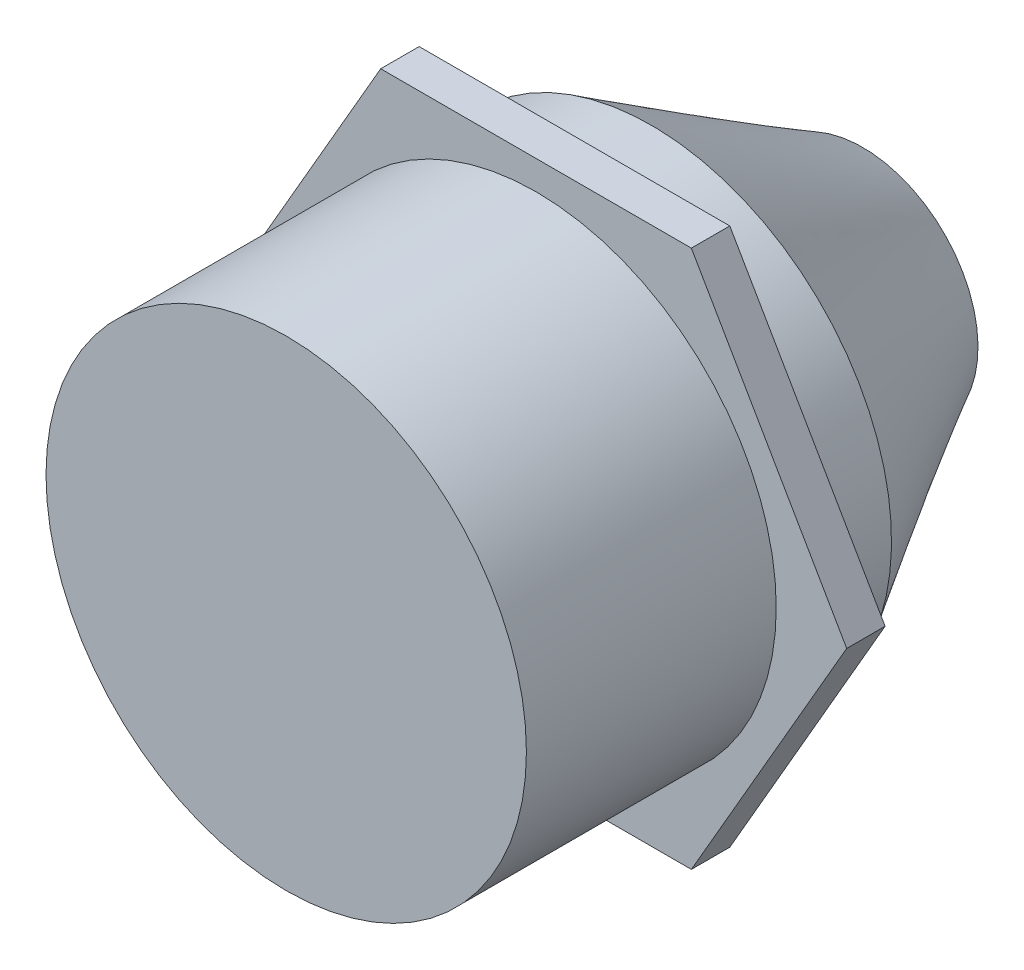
ISO-10303-21;
HEADER;
FILE_DESCRIPTION(('STEP AP214'),'2;1');
FILE_NAME('part.step','',(''),(''),'','','');
FILE_SCHEMA(('AUTOMOTIVE_DESIGN { 1 0 10303 214 1 1 1 1 }'));
ENDSEC;
DATA;
#1=APPLICATION_CONTEXT('core data for automotive mechanical design processes');
#2=APPLICATION_PROTOCOL_DEFINITION('international standard','automotive_design',2000,#1);
#3=PRODUCT_CONTEXT('',#1,'mechanical');
#4=PRODUCT('Part','Part','',(#3));
#5=PRODUCT_RELATED_PRODUCT_CATEGORY('part','',(#4));
#6=PRODUCT_DEFINITION_FORMATION('','',#4);
#7=PRODUCT_DEFINITION_CONTEXT('part definition',#1,'design');
#8=PRODUCT_DEFINITION('design','',#6,#7);
#9=PRODUCT_DEFINITION_SHAPE('','',#8);
#10=(LENGTH_UNIT() NAMED_UNIT(*) SI_UNIT(.MILLI.,.METRE.));
#11=(NAMED_UNIT(*) PLANE_ANGLE_UNIT() SI_UNIT($,.RADIAN.));
#12=(NAMED_UNIT(*) SI_UNIT($,.STERADIAN.) SOLID_ANGLE_UNIT());
#13=UNCERTAINTY_MEASURE_WITH_UNIT(LENGTH_MEASURE(1.E-05),#10,'distance_accuracy_value','');
#14=(GEOMETRIC_REPRESENTATION_CONTEXT(3) GLOBAL_UNCERTAINTY_ASSIGNED_CONTEXT((#13)) GLOBAL_UNIT_ASSIGNED_CONTEXT((#10,
#11,#12)) REPRESENTATION_CONTEXT('',''));
#15=CARTESIAN_POINT('',(0.,0.,0.));
#16=DIRECTION('',(0.,0.,1.));
#17=DIRECTION('',(1.,0.,0.));
#18=AXIS2_PLACEMENT_3D('',#15,#16,#17);
#19=CARTESIAN_POINT('',(0.,0.,-130.));
#20=DIRECTION('',(0.,0.,1.));
#21=DIRECTION('',(1.,0.,0.));
#22=AXIS2_PLACEMENT_3D('',#19,#20,#21);
#23=CYLINDRICAL_SURFACE('',#22,125.);
#24=CARTESIAN_POINT('',(0.,0.,-130.));
#25=DIRECTION('',(0.,0.,1.));
#26=DIRECTION('',(1.,0.,0.));
#27=AXIS2_PLACEMENT_3D('',#24,#25,#26);
#28=CIRCLE('',#27,125.);
#29=CARTESIAN_POINT('',(125.,0.,-130.));
#30=VERTEX_POINT('',#29);
#31=EDGE_CURVE('E149',#30,#30,#28,.T.);
#32=ORIENTED_EDGE('',*,*,#31,.T.);
#33=EDGE_LOOP('',(#32));
#34=FACE_BOUND('',#33,.T.);
#35=CARTESIAN_POINT('',(0.,0.,0.));
#36=DIRECTION('',(0.,0.,1.));
#37=DIRECTION('',(1.,0.,0.));
#38=AXIS2_PLACEMENT_3D('',#35,#36,#37);
#39=CIRCLE('',#38,125.);
#40=CARTESIAN_POINT('',(125.,0.,0.));
#41=VERTEX_POINT('',#40);
#42=EDGE_CURVE('E51',#41,#41,#39,.T.);
#43=ORIENTED_EDGE('',*,*,#42,.F.);
#44=EDGE_LOOP('',(#43));
#45=FACE_BOUND('',#44,.T.);
#46=ADVANCED_FACE('F42',(#34,#45),#23,.T.);
#47=CARTESIAN_POINT('',(0.,0.,0.));
#48=DIRECTION('',(0.,0.,1.));
#49=DIRECTION('',(1.,0.,0.));
#50=AXIS2_PLACEMENT_3D('',#47,#48,#49);
#51=PLANE('',#50);
#52=ORIENTED_EDGE('',*,*,#42,.T.);
#53=EDGE_LOOP('',(#52));
#54=FACE_BOUND('',#53,.T.);
#55=ADVANCED_FACE('F195',(#54),#51,.T.);
#56=CARTESIAN_POINT('',(-161.658075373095,0.,-150.));
#57=DIRECTION('',(0.866025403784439,-0.5,0.));
#58=DIRECTION('',(0.5,0.866025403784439,0.));
#59=AXIS2_PLACEMENT_3D('',#56,#57,#58);
#60=PLANE('',#59);
#61=DIRECTION('',(0.5,0.866025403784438,0.));
#62=VECTOR('',#61,1.);
#63=CARTESIAN_POINT('',(-161.658075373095,0.,-130.));
#64=LINE('',#63,#62);
#65=CARTESIAN_POINT('',(-161.658075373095,0.,-130.));
#66=VERTEX_POINT('',#65);
#67=CARTESIAN_POINT('',(-80.8290376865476,140.,-130.));
#68=VERTEX_POINT('',#67);
#69=EDGE_CURVE('E129',#66,#68,#64,.T.);
#70=ORIENTED_EDGE('',*,*,#69,.T.);
#71=DIRECTION('',(0.,0.,1.));
#72=VECTOR('',#71,1.);
#73=CARTESIAN_POINT('',(-80.8290376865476,140.,-150.));
#74=LINE('',#73,#72);
#75=CARTESIAN_POINT('',(-80.8290376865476,140.,-150.));
#76=VERTEX_POINT('',#75);
#77=EDGE_CURVE('E147',#76,#68,#74,.T.);
#78=ORIENTED_EDGE('',*,*,#77,.F.);
#79=DIRECTION('',(0.5,0.866025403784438,0.));
#80=VECTOR('',#79,1.);
#81=CARTESIAN_POINT('',(-161.658075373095,0.,-150.));
#82=LINE('',#81,#80);
#83=CARTESIAN_POINT('',(-161.658075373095,0.,-150.));
#84=VERTEX_POINT('',#83);
#85=EDGE_CURVE('E140',#84,#76,#82,.T.);
#86=ORIENTED_EDGE('',*,*,#85,.F.);
#87=DIRECTION('',(0.,0.,1.));
#88=VECTOR('',#87,1.);
#89=CARTESIAN_POINT('',(-161.658075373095,0.,-150.));
#90=LINE('',#89,#88);
#91=EDGE_CURVE('E125',#84,#66,#90,.T.);
#92=ORIENTED_EDGE('',*,*,#91,.T.);
#93=EDGE_LOOP('',(#70,#78,#86,#92));
#94=FACE_BOUND('',#93,.T.);
#95=ADVANCED_FACE('F181',(#94),#60,.F.);
#96=CARTESIAN_POINT('',(-80.8290376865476,140.,-150.));
#97=DIRECTION('',(0.,-1.,0.));
#98=DIRECTION('',(1.,0.,0.));
#99=AXIS2_PLACEMENT_3D('',#96,#97,#98);
#100=PLANE('',#99);
#101=DIRECTION('',(1.,0.,0.));
#102=VECTOR('',#101,1.);
#103=CARTESIAN_POINT('',(-80.8290376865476,140.,-130.));
#104=LINE('',#103,#102);
#105=CARTESIAN_POINT('',(80.8290376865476,140.,-130.));
#106=VERTEX_POINT('',#105);
#107=EDGE_CURVE('E132',#68,#106,#104,.T.);
#108=ORIENTED_EDGE('',*,*,#107,.T.);
#109=DIRECTION('',(0.,0.,1.));
#110=VECTOR('',#109,1.);
#111=CARTESIAN_POINT('',(80.8290376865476,140.,-150.));
#112=LINE('',#111,#110);
#113=CARTESIAN_POINT('',(80.8290376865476,140.,-150.));
#114=VERTEX_POINT('',#113);
#115=EDGE_CURVE('E144',#114,#106,#112,.T.);
#116=ORIENTED_EDGE('',*,*,#115,.F.);
#117=DIRECTION('',(1.,0.,0.));
#118=VECTOR('',#117,1.);
#119=CARTESIAN_POINT('',(-80.8290376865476,140.,-150.));
#120=LINE('',#119,#118);
#121=EDGE_CURVE('E98',#76,#114,#120,.T.);
#122=ORIENTED_EDGE('',*,*,#121,.F.);
#123=ORIENTED_EDGE('',*,*,#77,.T.);
#124=EDGE_LOOP('',(#108,#116,#122,#123));
#125=FACE_BOUND('',#124,.T.);
#126=ADVANCED_FACE('F173',(#125),#100,.F.);
#127=CARTESIAN_POINT('',(80.8290376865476,140.,-150.));
#128=DIRECTION('',(-0.866025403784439,-0.5,0.));
#129=DIRECTION('',(0.5,-0.866025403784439,0.));
#130=AXIS2_PLACEMENT_3D('',#127,#128,#129);
#131=PLANE('',#130);
#132=DIRECTION('',(0.499999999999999,-0.866025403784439,0.));
#133=VECTOR('',#132,1.);
#134=CARTESIAN_POINT('',(80.8290376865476,140.,-130.));
#135=LINE('',#134,#133);
#136=CARTESIAN_POINT('',(161.658075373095,-1.11022302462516E-13,-130.));
#137=VERTEX_POINT('',#136);
#138=EDGE_CURVE('E135',#106,#137,#135,.T.);
#139=ORIENTED_EDGE('',*,*,#138,.T.);
#140=DIRECTION('',(0.,0.,1.));
#141=VECTOR('',#140,1.);
#142=CARTESIAN_POINT('',(161.658075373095,-1.11022302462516E-13,-150.));
#143=LINE('',#142,#141);
#144=CARTESIAN_POINT('',(161.658075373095,-1.11022302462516E-13,-150.));
#145=VERTEX_POINT('',#144);
#146=EDGE_CURVE('E120',#145,#137,#143,.T.);
#147=ORIENTED_EDGE('',*,*,#146,.F.);
#148=DIRECTION('',(0.499999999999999,-0.866025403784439,0.));
#149=VECTOR('',#148,1.);
#150=CARTESIAN_POINT('',(80.8290376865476,140.,-150.));
#151=LINE('',#150,#149);
#152=EDGE_CURVE('E111',#114,#145,#151,.T.);
#153=ORIENTED_EDGE('',*,*,#152,.F.);
#154=ORIENTED_EDGE('',*,*,#115,.T.);
#155=EDGE_LOOP('',(#139,#147,#153,#154));
#156=FACE_BOUND('',#155,.T.);
#157=ADVANCED_FACE('F176',(#156),#131,.F.);
#158=CARTESIAN_POINT('',(161.658075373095,-1.11022302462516E-13,-150.));
#159=DIRECTION('',(-0.866025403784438,0.5,0.));
#160=DIRECTION('',(-0.5,-0.866025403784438,0.));
#161=AXIS2_PLACEMENT_3D('',#158,#159,#160);
#162=PLANE('',#161);
#163=DIRECTION('',(-0.5,-0.866025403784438,0.));
#164=VECTOR('',#163,1.);
#165=CARTESIAN_POINT('',(161.658075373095,-1.11022302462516E-13,-130.));
#166=LINE('',#165,#164);
#167=CARTESIAN_POINT('',(80.8290376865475,-140.,-130.));
#168=VERTEX_POINT('',#167);
#169=EDGE_CURVE('E119',#137,#168,#166,.T.);
#170=ORIENTED_EDGE('',*,*,#169,.T.);
#171=DIRECTION('',(0.,0.,1.));
#172=VECTOR('',#171,1.);
#173=CARTESIAN_POINT('',(80.8290376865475,-140.,-150.));
#174=LINE('',#173,#172);
#175=CARTESIAN_POINT('',(80.8290376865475,-140.,-150.));
#176=VERTEX_POINT('',#175);
#177=EDGE_CURVE('E116',#176,#168,#174,.T.);
#178=ORIENTED_EDGE('',*,*,#177,.F.);
#179=DIRECTION('',(-0.5,-0.866025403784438,0.));
#180=VECTOR('',#179,1.);
#181=CARTESIAN_POINT('',(161.658075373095,-1.11022302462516E-13,-150.));
#182=LINE('',#181,#180);
#183=EDGE_CURVE('E105',#145,#176,#182,.T.);
#184=ORIENTED_EDGE('',*,*,#183,.F.);
#185=ORIENTED_EDGE('',*,*,#146,.T.);
#186=EDGE_LOOP('',(#170,#178,#184,#185));
#187=FACE_BOUND('',#186,.T.);
#188=ADVANCED_FACE('F117',(#187),#162,.F.);
#189=CARTESIAN_POINT('',(80.8290376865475,-140.,-150.));
#190=DIRECTION('',(0.,1.,0.));
#191=DIRECTION('',(-1.,0.,0.));
#192=AXIS2_PLACEMENT_3D('',#189,#190,#191);
#193=PLANE('',#192);
#194=DIRECTION('',(-1.,0.,0.));
#195=VECTOR('',#194,1.);
#196=CARTESIAN_POINT('',(80.8290376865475,-140.,-130.));
#197=LINE('',#196,#195);
#198=CARTESIAN_POINT('',(-80.8290376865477,-140.,-130.));
#199=VERTEX_POINT('',#198);
#200=EDGE_CURVE('E83',#168,#199,#197,.T.);
#201=ORIENTED_EDGE('',*,*,#200,.T.);
#202=DIRECTION('',(0.,0.,1.));
#203=VECTOR('',#202,1.);
#204=CARTESIAN_POINT('',(-80.8290376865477,-140.,-150.));
#205=LINE('',#204,#203);
#206=CARTESIAN_POINT('',(-80.8290376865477,-140.,-150.));
#207=VERTEX_POINT('',#206);
#208=EDGE_CURVE('E121',#207,#199,#205,.T.);
#209=ORIENTED_EDGE('',*,*,#208,.F.);
#210=DIRECTION('',(-1.,0.,0.));
#211=VECTOR('',#210,1.);
#212=CARTESIAN_POINT('',(80.8290376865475,-140.,-150.));
#213=LINE('',#212,#211);
#214=EDGE_CURVE('E109',#176,#207,#213,.T.);
#215=ORIENTED_EDGE('',*,*,#214,.F.);
#216=ORIENTED_EDGE('',*,*,#177,.T.);
#217=EDGE_LOOP('',(#201,#209,#215,#216));
#218=FACE_BOUND('',#217,.T.);
#219=ADVANCED_FACE('F123',(#218),#193,.F.);
#220=CARTESIAN_POINT('',(-80.8290376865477,-140.,-150.));
#221=DIRECTION('',(0.866025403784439,0.499999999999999,0.));
#222=DIRECTION('',(-0.499999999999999,0.866025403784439,0.));
#223=AXIS2_PLACEMENT_3D('',#220,#221,#222);
#224=PLANE('',#223);
#225=DIRECTION('',(-0.499999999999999,0.866025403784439,0.));
#226=VECTOR('',#225,1.);
#227=CARTESIAN_POINT('',(-80.8290376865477,-140.,-130.));
#228=LINE('',#227,#226);
#229=EDGE_CURVE('E89',#199,#66,#228,.T.);
#230=ORIENTED_EDGE('',*,*,#229,.T.);
#231=ORIENTED_EDGE('',*,*,#91,.F.);
#232=DIRECTION('',(-0.499999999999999,0.866025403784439,0.));
#233=VECTOR('',#232,1.);
#234=CARTESIAN_POINT('',(-80.8290376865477,-140.,-150.));
#235=LINE('',#234,#233);
#236=EDGE_CURVE('E60',#207,#84,#235,.T.);
#237=ORIENTED_EDGE('',*,*,#236,.F.);
#238=ORIENTED_EDGE('',*,*,#208,.T.);
#239=EDGE_LOOP('',(#230,#231,#237,#238));
#240=FACE_BOUND('',#239,.T.);
#241=ADVANCED_FACE('F182',(#240),#224,.F.);
#242=CARTESIAN_POINT('',(0.,0.,-150.));
#243=DIRECTION('',(0.,0.,-1.));
#244=DIRECTION('',(-1.,0.,0.));
#245=AXIS2_PLACEMENT_3D('',#242,#243,#244);
#246=PLANE('',#245);
#247=CARTESIAN_POINT('',(0.,0.,-150.));
#248=DIRECTION('',(0.,0.,-1.));
#249=DIRECTION('',(-1.,0.,0.));
#250=AXIS2_PLACEMENT_3D('',#247,#248,#249);
#251=CIRCLE('',#250,125.);
#252=CARTESIAN_POINT('',(-125.,0.,-150.));
#253=VERTEX_POINT('',#252);
#254=EDGE_CURVE('E12',#253,#253,#251,.T.);
#255=ORIENTED_EDGE('',*,*,#254,.F.);
#256=EDGE_LOOP('',(#255));
#257=FACE_BOUND('',#256,.T.);
#258=ORIENTED_EDGE('',*,*,#85,.T.);
#259=ORIENTED_EDGE('',*,*,#121,.T.);
#260=ORIENTED_EDGE('',*,*,#152,.T.);
#261=ORIENTED_EDGE('',*,*,#183,.T.);
#262=ORIENTED_EDGE('',*,*,#214,.T.);
#263=ORIENTED_EDGE('',*,*,#236,.T.);
#264=EDGE_LOOP('',(#258,#259,#260,#261,#262,#263));
#265=FACE_BOUND('',#264,.T.);
#266=ADVANCED_FACE('F107',(#257,#265),#246,.T.);
#267=CARTESIAN_POINT('',(0.,0.,-130.));
#268=DIRECTION('',(0.,0.,-1.));
#269=DIRECTION('',(-1.,0.,0.));
#270=AXIS2_PLACEMENT_3D('',#267,#268,#269);
#271=PLANE('',#270);
#272=ORIENTED_EDGE('',*,*,#31,.F.);
#273=EDGE_LOOP('',(#272));
#274=FACE_BOUND('',#273,.T.);
#275=ORIENTED_EDGE('',*,*,#69,.F.);
#276=ORIENTED_EDGE('',*,*,#229,.F.);
#277=ORIENTED_EDGE('',*,*,#200,.F.);
#278=ORIENTED_EDGE('',*,*,#169,.F.);
#279=ORIENTED_EDGE('',*,*,#138,.F.);
#280=ORIENTED_EDGE('',*,*,#107,.F.);
#281=EDGE_LOOP('',(#275,#276,#277,#278,#279,#280));
#282=FACE_BOUND('',#281,.T.);
#283=ADVANCED_FACE('F179',(#274,#282),#271,.F.);
#284=CARTESIAN_POINT('',(0.,0.,-190.));
#285=DIRECTION('',(0.,0.,1.));
#286=DIRECTION('',(1.,0.,0.));
#287=AXIS2_PLACEMENT_3D('',#284,#285,#286);
#288=CYLINDRICAL_SURFACE('',#287,125.);
#289=CARTESIAN_POINT('',(0.,0.,-190.));
#290=DIRECTION('',(0.,0.,1.));
#291=DIRECTION('',(1.,0.,0.));
#292=AXIS2_PLACEMENT_3D('',#289,#290,#291);
#293=CIRCLE('',#292,125.);
#294=CARTESIAN_POINT('',(124.717613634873,8.39743110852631,-190.));
#295=VERTEX_POINT('',#294);
#296=EDGE_CURVE('E133',#295,#295,#293,.F.);
#297=ORIENTED_EDGE('',*,*,#296,.F.);
#298=EDGE_LOOP('',(#297));
#299=FACE_BOUND('',#298,.T.);
#300=ORIENTED_EDGE('',*,*,#254,.T.);
#301=EDGE_LOOP('',(#300));
#302=FACE_BOUND('',#301,.T.);
#303=ADVANCED_FACE('F205',(#299,#302),#288,.T.);
#304=CARTESIAN_POINT('',(0.,0.,-300.));
#305=DIRECTION('',(0.,0.,1.));
#306=DIRECTION('',(1.,0.,0.));
#307=AXIS2_PLACEMENT_3D('',#304,#305,#306);
#308=PLANE('',#307);
#309=CARTESIAN_POINT('',(0.,0.,-300.));
#310=DIRECTION('',(0.,0.,1.));
#311=DIRECTION('',(1.,0.,0.));
#312=AXIS2_PLACEMENT_3D('',#309,#310,#311);
#313=CIRCLE('',#312,60.);
#314=CARTESIAN_POINT('',(58.4461440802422,-13.5664380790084,-300.));
#315=VERTEX_POINT('',#314);
#316=EDGE_CURVE('E154',#315,#315,#313,.T.);
#317=ORIENTED_EDGE('',*,*,#316,.F.);
#318=EDGE_LOOP('',(#317));
#319=FACE_BOUND('',#318,.T.);
#320=ADVANCED_FACE('F209',(#319),#308,.F.);
#321=CARTESIAN_POINT('',(124.717613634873,8.39743110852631,-190.));
#322=CARTESIAN_POINT('',(58.4461440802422,-13.5664380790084,-300.));
#323=CARTESIAN_POINT('',(141.512475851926,-241.03779616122,-190.));
#324=CARTESIAN_POINT('',(31.3132679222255,-130.458726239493,-300.));
#325=CARTESIAN_POINT('',(-107.922751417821,-257.832658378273,-190.));
#326=CARTESIAN_POINT('',(-85.5790202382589,-103.325850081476,-300.));
#327=CARTESIAN_POINT('',(-124.717613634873,-8.39743110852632,-190.));
#328=CARTESIAN_POINT('',(-58.4461440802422,13.5664380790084,-300.));
#329=CARTESIAN_POINT('',(-141.512475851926,241.03779616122,-190.));
#330=CARTESIAN_POINT('',(-31.3132679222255,130.458726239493,-300.));
#331=CARTESIAN_POINT('',(107.922751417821,257.832658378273,-190.));
#332=CARTESIAN_POINT('',(85.579020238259,103.325850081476,-300.));
#333=CARTESIAN_POINT('',(124.717613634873,8.39743110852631,-190.));
#334=CARTESIAN_POINT('',(58.4461440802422,-13.5664380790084,-300.));
#335=(BOUNDED_SURFACE() B_SPLINE_SURFACE(3,1,((#321,#322),(#323,#324),(#325,#326),(#327,#328),
(#329,#330),(#331,#332),(#333,#334)),.UNSPECIFIED.,.T.,.F.,.F.) B_SPLINE_SURFACE_WITH_KNOTS((4,
3,4),(2,2),(0.,0.5,1.),(0.,1.),
.UNSPECIFIED.) GEOMETRIC_REPRESENTATION_ITEM() RATIONAL_B_SPLINE_SURFACE(((1.,1.),
(0.333333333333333,0.333333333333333),(0.333333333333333,0.333333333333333),(1.,1.),
(0.333333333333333,0.333333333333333),(0.333333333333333,0.333333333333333),(1.,1.))) REPRESENTATION_ITEM('') SURFACE());
#336=CARTESIAN_POINT('',(124.717613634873,8.39743110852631,-190.));
#337=CARTESIAN_POINT('',(124.027285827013,8.16864080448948,-191.145833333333));
#338=CARTESIAN_POINT('',(123.336958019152,7.93985050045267,-192.291666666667));
#339=CARTESIAN_POINT('',(121.95630240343,7.48226989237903,-194.583333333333));
#340=CARTESIAN_POINT('',(121.26597459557,7.25347958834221,-195.729166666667));
#341=CARTESIAN_POINT('',(119.885318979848,6.79589898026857,-198.020833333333));
#342=CARTESIAN_POINT('',(119.194991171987,6.56710867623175,-199.166666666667));
#343=CARTESIAN_POINT('',(117.814335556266,6.10952806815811,-201.458333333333));
#344=CARTESIAN_POINT('',(117.124007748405,5.88073776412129,-202.604166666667));
#345=CARTESIAN_POINT('',(115.743352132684,5.42315715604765,-204.895833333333));
#346=CARTESIAN_POINT('',(115.053024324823,5.19436685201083,-206.041666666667));
#347=CARTESIAN_POINT('',(113.672368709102,4.73678624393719,-208.333333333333));
#348=CARTESIAN_POINT('',(112.982040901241,4.50799593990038,-209.479166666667));
#349=CARTESIAN_POINT('',(111.601385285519,4.05041533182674,-211.770833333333));
#350=CARTESIAN_POINT('',(110.911057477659,3.82162502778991,-212.916666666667));
#351=CARTESIAN_POINT('',(109.530401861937,3.36404441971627,-215.208333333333));
#352=CARTESIAN_POINT('',(108.840074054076,3.13525411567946,-216.354166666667));
#353=CARTESIAN_POINT('',(107.459418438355,2.67767350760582,-218.645833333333));
#354=CARTESIAN_POINT('',(106.769090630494,2.448883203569,-219.791666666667));
#355=CARTESIAN_POINT('',(105.388435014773,1.99130259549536,-222.083333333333));
#356=CARTESIAN_POINT('',(104.698107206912,1.76251229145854,-223.229166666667));
#357=CARTESIAN_POINT('',(103.31745159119,1.3049316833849,-225.520833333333));
#358=CARTESIAN_POINT('',(102.62712378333,1.07614137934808,-226.666666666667));
#359=CARTESIAN_POINT('',(101.246468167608,0.61856077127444,-228.958333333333));
#360=CARTESIAN_POINT('',(100.556140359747,0.38977046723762,-230.104166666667));
#361=CARTESIAN_POINT('',(99.175484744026,-0.0678101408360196,-232.395833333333));
#362=CARTESIAN_POINT('',(98.4851569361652,-0.296600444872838,-233.541666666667));
#363=CARTESIAN_POINT('',(97.1045013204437,-0.754181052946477,-235.833333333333));
#364=CARTESIAN_POINT('',(96.414173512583,-0.982971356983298,-236.979166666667));
#365=CARTESIAN_POINT('',(95.0335178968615,-1.44055196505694,-239.270833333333));
#366=CARTESIAN_POINT('',(94.3431900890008,-1.66934226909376,-240.416666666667));
#367=CARTESIAN_POINT('',(92.9625344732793,-2.1269228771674,-242.708333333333));
#368=CARTESIAN_POINT('',(92.2722066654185,-2.35571318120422,-243.854166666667));
#369=CARTESIAN_POINT('',(90.8915510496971,-2.81329378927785,-246.145833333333));
#370=CARTESIAN_POINT('',(90.2012232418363,-3.04208409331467,-247.291666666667));
#371=CARTESIAN_POINT('',(88.8205676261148,-3.49966470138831,-249.583333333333));
#372=CARTESIAN_POINT('',(88.1302398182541,-3.72845500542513,-250.729166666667));
#373=CARTESIAN_POINT('',(86.7495842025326,-4.18603561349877,-253.020833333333));
#374=CARTESIAN_POINT('',(86.0592563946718,-4.41482591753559,-254.166666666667));
#375=CARTESIAN_POINT('',(84.6786007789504,-4.87240652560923,-256.458333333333));
#376=CARTESIAN_POINT('',(83.9882729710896,-5.10119682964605,-257.604166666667));
#377=CARTESIAN_POINT('',(82.6076173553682,-5.55877743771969,-259.895833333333));
#378=CARTESIAN_POINT('',(81.9172895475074,-5.78756774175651,-261.041666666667));
#379=CARTESIAN_POINT('',(80.5366339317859,-6.24514834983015,-263.333333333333));
#380=CARTESIAN_POINT('',(79.8463061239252,-6.47393865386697,-264.479166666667));
#381=CARTESIAN_POINT('',(78.4656505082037,-6.93151926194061,-266.770833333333));
#382=CARTESIAN_POINT('',(77.775322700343,-7.16030956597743,-267.916666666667));
#383=CARTESIAN_POINT('',(76.3946670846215,-7.61789017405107,-270.208333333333));
#384=CARTESIAN_POINT('',(75.7043392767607,-7.84668047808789,-271.354166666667));
#385=CARTESIAN_POINT('',(74.3236836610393,-8.30426108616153,-273.645833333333));
#386=CARTESIAN_POINT('',(73.6333558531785,-8.53305139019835,-274.791666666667));
#387=CARTESIAN_POINT('',(72.252700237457,-8.99063199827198,-277.083333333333));
#388=CARTESIAN_POINT('',(71.5623724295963,-9.2194223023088,-278.229166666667));
#389=CARTESIAN_POINT('',(70.1817168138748,-9.67700291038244,-280.520833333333));
#390=CARTESIAN_POINT('',(69.4913890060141,-9.90579321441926,-281.666666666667));
#391=CARTESIAN_POINT('',(68.1107333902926,-10.3633738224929,-283.958333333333));
#392=CARTESIAN_POINT('',(67.4204055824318,-10.5921641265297,-285.104166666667));
#393=CARTESIAN_POINT('',(66.0397499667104,-11.0497447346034,-287.395833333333));
#394=CARTESIAN_POINT('',(65.3494221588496,-11.2785350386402,-288.541666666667));
#395=CARTESIAN_POINT('',(63.9687665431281,-11.7361156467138,-290.833333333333));
#396=CARTESIAN_POINT('',(63.2784387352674,-11.9649059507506,-291.979166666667));
#397=CARTESIAN_POINT('',(61.8977831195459,-12.4224865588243,-294.270833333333));
#398=CARTESIAN_POINT('',(61.2074553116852,-12.6512768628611,-295.416666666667));
#399=CARTESIAN_POINT('',(59.8267996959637,-13.1088574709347,-297.708333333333));
#400=CARTESIAN_POINT('',(59.1364718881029,-13.3376477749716,-298.854166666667));
#401=CARTESIAN_POINT('',(58.4461440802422,-13.5664380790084,-300.));
#402=B_SPLINE_CURVE_WITH_KNOTS('',3,(#336,#337,#338,#339,#340,#341,#342,#343,#344,#345,#346,
#347,#348,#349,#350,#351,#352,#353,#354,#355,#356,#357,#358,#359,#360,#361,#362,#363,#364,#365,
#366,#367,#368,#369,#370,#371,#372,#373,#374,#375,#376,#377,#378,#379,#380,#381,#382,#383,#384,
#385,#386,#387,#388,#389,#390,#391,#392,#393,#394,#395,#396,#397,#398,#399,#400,#401),
.UNSPECIFIED.,.F.,.F.,(4,2,2,2,2,2,2,2,2,2,2,2,2,2,2,2,2,2,2,2,2,2,2,2,2,2,2,2,2,2,2,2,4),(0.,
4.07142280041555,8.14284560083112,12.2142684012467,16.2856912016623,20.3571140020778,
24.4285368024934,28.4999596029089,32.5713824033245,36.6428052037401,40.7142280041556,
44.7856508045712,48.8570736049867,52.9284964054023,56.9999192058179,61.0713420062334,
65.142764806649,69.2141876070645,73.2856104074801,77.3570332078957,81.4284560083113,
85.4998788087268,89.5713016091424,93.6427244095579,97.7141472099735,101.785570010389,
105.856992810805,109.92841561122,113.999838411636,118.071261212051,122.142684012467,
126.214106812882,130.285529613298),.UNSPECIFIED.);
#403=EDGE_CURVE('BSEAM213',#295,#315,#402,.T.);
#404=ORIENTED_EDGE('',*,*,#296,.T.);
#405=ORIENTED_EDGE('',*,*,#316,.T.);
#406=ORIENTED_EDGE('',*,*,#403,.T.);
#407=ORIENTED_EDGE('',*,*,#403,.F.);
#408=EDGE_LOOP('',(#404,#406,#405,#407));
#409=FACE_BOUND('',#408,.T.);
#410=ADVANCED_FACE('F213',(#409),#335,.T.);
#411=CLOSED_SHELL('',(#46,#55,#95,#126,#157,#188,#219,#241,#266,#283,#303,#320,#410));
#412=MANIFOLD_SOLID_BREP('B2',#411);
#413=ADVANCED_BREP_SHAPE_REPRESENTATION('',(#18,#412),#14);
#414=SHAPE_DEFINITION_REPRESENTATION(#9,#413);
ENDSEC;
END-ISO-10303-21;
